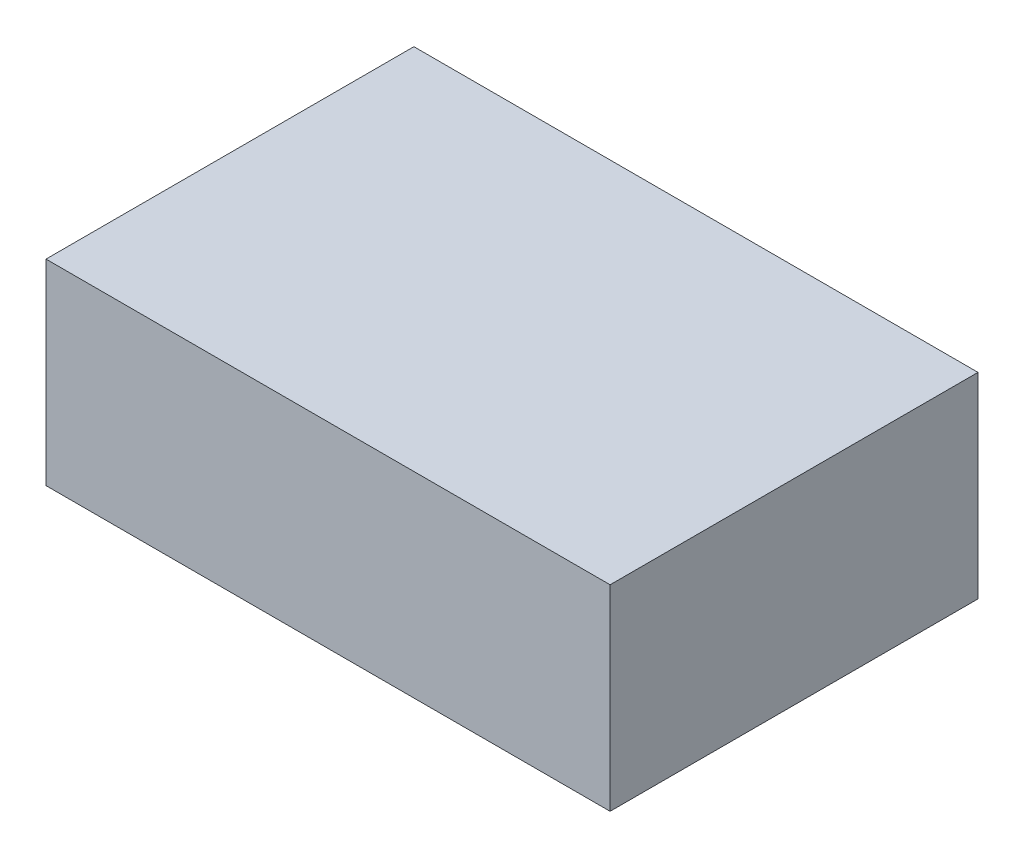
from build123d import *

# Parameters (mm, degrees)
SKIZZE1_W                       = 46
SKIZZE1_H                       = 16
AUFSATZ_LINEAR_AUSTRAGEN1_DEPTH = 30


with BuildPart() as part:
    # Skizze1 → Aufsatz-Linear austragen1 (new body)
    with BuildSketch(Plane.XY):
        with Locations((25, 10)):
            Rectangle(SKIZZE1_W, SKIZZE1_H)
    extrude(amount=AUFSATZ_LINEAR_AUSTRAGEN1_DEPTH)


solid = part.part
